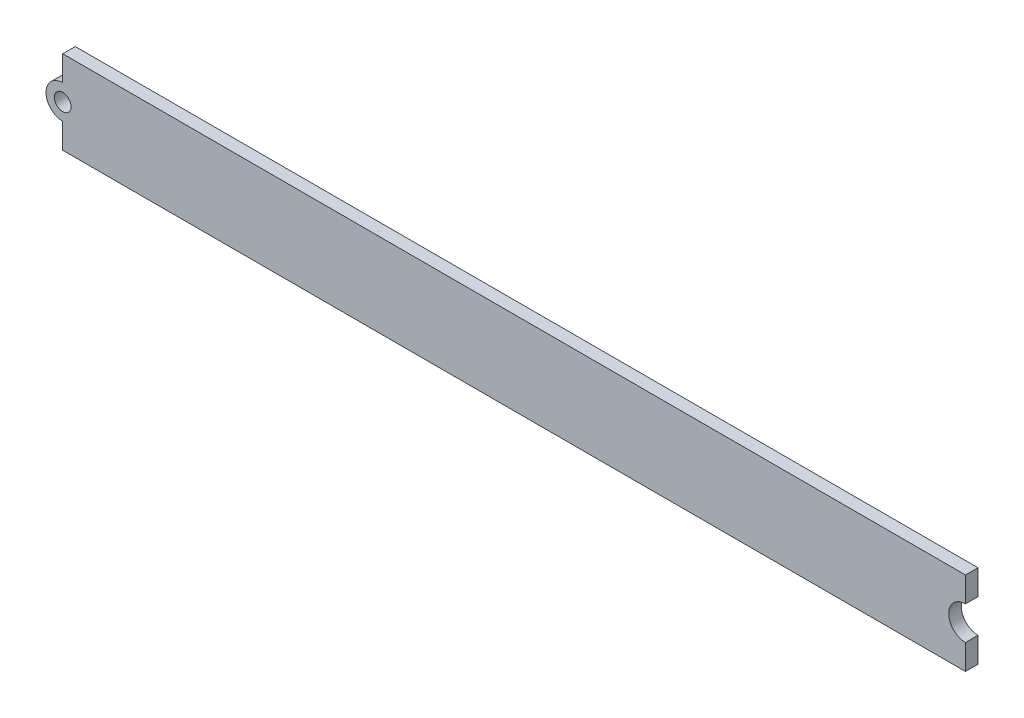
from build123d import *

# Parameters (mm, degrees)
ESQUISSE1_R        = 1
BOSS_EXTRU_1_DEPTH = 1.5


with BuildPart() as part:
    # Esquisse1 → Boss.-Extru.1 (new body)
    with BuildSketch(Plane.XY):
        with BuildLine():
            Line((-54, -2), (-54, -5))
            Line((-54, -5), (54, -5))
            Line((54, -5), (54, -2))
            ThreePointArc((54, -2), (52, 0), (54, 2))
            Line((54, 2), (54, 5))
            Line((54, 5), (-54, 5))
            Line((-54, 5), (-54, 2))
            ThreePointArc((-54, 2), (-56, 0), (-54, -2))
        make_face()
        with Locations((-54, 0)):
            Circle(ESQUISSE1_R, mode=Mode.SUBTRACT)
    extrude(amount=BOSS_EXTRU_1_DEPTH)


solid = part.part
